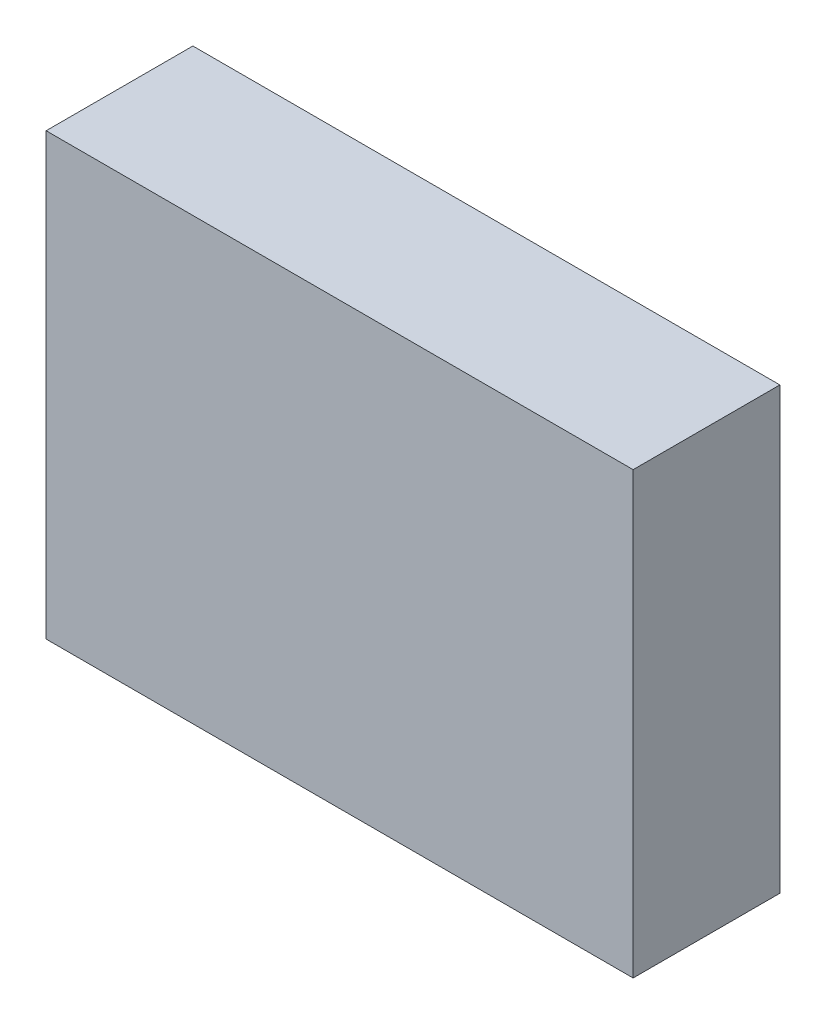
ISO-10303-21;
HEADER;
FILE_DESCRIPTION(('STEP AP214'),'2;1');
FILE_NAME('part.step','',(''),(''),'','','');
FILE_SCHEMA(('AUTOMOTIVE_DESIGN { 1 0 10303 214 1 1 1 1 }'));
ENDSEC;
DATA;
#1=APPLICATION_CONTEXT('core data for automotive mechanical design processes');
#2=APPLICATION_PROTOCOL_DEFINITION('international standard','automotive_design',2000,#1);
#3=PRODUCT_CONTEXT('',#1,'mechanical');
#4=PRODUCT('Part','Part','',(#3));
#5=PRODUCT_RELATED_PRODUCT_CATEGORY('part','',(#4));
#6=PRODUCT_DEFINITION_FORMATION('','',#4);
#7=PRODUCT_DEFINITION_CONTEXT('part definition',#1,'design');
#8=PRODUCT_DEFINITION('design','',#6,#7);
#9=PRODUCT_DEFINITION_SHAPE('','',#8);
#10=(LENGTH_UNIT() NAMED_UNIT(*) SI_UNIT(.MILLI.,.METRE.));
#11=(NAMED_UNIT(*) PLANE_ANGLE_UNIT() SI_UNIT($,.RADIAN.));
#12=(NAMED_UNIT(*) SI_UNIT($,.STERADIAN.) SOLID_ANGLE_UNIT());
#13=UNCERTAINTY_MEASURE_WITH_UNIT(LENGTH_MEASURE(1.E-05),#10,'distance_accuracy_value','');
#14=(GEOMETRIC_REPRESENTATION_CONTEXT(3) GLOBAL_UNCERTAINTY_ASSIGNED_CONTEXT((#13)) GLOBAL_UNIT_ASSIGNED_CONTEXT((#10,
#11,#12)) REPRESENTATION_CONTEXT('',''));
#15=CARTESIAN_POINT('',(0.,0.,0.));
#16=DIRECTION('',(0.,0.,1.));
#17=DIRECTION('',(1.,0.,0.));
#18=AXIS2_PLACEMENT_3D('',#15,#16,#17);
#19=CARTESIAN_POINT('',(0.,0.,3.));
#20=DIRECTION('',(1.,0.,0.));
#21=DIRECTION('',(0.,0.,-1.));
#22=AXIS2_PLACEMENT_3D('',#19,#20,#21);
#23=PLANE('',#22);
#24=DIRECTION('',(0.,-1.,0.));
#25=VECTOR('',#24,1.);
#26=CARTESIAN_POINT('',(0.,0.,0.));
#27=LINE('',#26,#25);
#28=CARTESIAN_POINT('',(0.,9.,0.));
#29=VERTEX_POINT('',#28);
#30=CARTESIAN_POINT('',(0.,0.,0.));
#31=VERTEX_POINT('',#30);
#32=EDGE_CURVE('E394',#29,#31,#27,.T.);
#33=ORIENTED_EDGE('',*,*,#32,.T.);
#34=DIRECTION('',(0.,0.,-1.));
#35=VECTOR('',#34,1.);
#36=CARTESIAN_POINT('',(0.,0.,3.));
#37=LINE('',#36,#35);
#38=CARTESIAN_POINT('',(0.,0.,3.));
#39=VERTEX_POINT('',#38);
#40=EDGE_CURVE('E11',#39,#31,#37,.T.);
#41=ORIENTED_EDGE('',*,*,#40,.F.);
#42=DIRECTION('',(0.,-1.,0.));
#43=VECTOR('',#42,1.);
#44=CARTESIAN_POINT('',(0.,0.,3.));
#45=LINE('',#44,#43);
#46=CARTESIAN_POINT('',(0.,9.,3.));
#47=VERTEX_POINT('',#46);
#48=EDGE_CURVE('E412',#47,#39,#45,.T.);
#49=ORIENTED_EDGE('',*,*,#48,.F.);
#50=DIRECTION('',(0.,0.,-1.));
#51=VECTOR('',#50,1.);
#52=CARTESIAN_POINT('',(0.,9.,3.));
#53=LINE('',#52,#51);
#54=EDGE_CURVE('E406',#47,#29,#53,.T.);
#55=ORIENTED_EDGE('',*,*,#54,.T.);
#56=EDGE_LOOP('',(#33,#41,#49,#55));
#57=FACE_BOUND('',#56,.T.);
#58=ADVANCED_FACE('F350',(#57),#23,.F.);
#59=CARTESIAN_POINT('',(0.,0.,3.));
#60=DIRECTION('',(0.,1.,0.));
#61=DIRECTION('',(0.,0.,1.));
#62=AXIS2_PLACEMENT_3D('',#59,#60,#61);
#63=PLANE('',#62);
#64=DIRECTION('',(1.,0.,0.));
#65=VECTOR('',#64,1.);
#66=CARTESIAN_POINT('',(0.,0.,0.));
#67=LINE('',#66,#65);
#68=CARTESIAN_POINT('',(12.,0.,0.));
#69=VERTEX_POINT('',#68);
#70=EDGE_CURVE('E390',#31,#69,#67,.T.);
#71=ORIENTED_EDGE('',*,*,#70,.T.);
#72=DIRECTION('',(0.,0.,-1.));
#73=VECTOR('',#72,1.);
#74=CARTESIAN_POINT('',(12.,0.,3.));
#75=LINE('',#74,#73);
#76=CARTESIAN_POINT('',(12.,0.,3.));
#77=VERTEX_POINT('',#76);
#78=EDGE_CURVE('E357',#77,#69,#75,.T.);
#79=ORIENTED_EDGE('',*,*,#78,.F.);
#80=DIRECTION('',(1.,0.,0.));
#81=VECTOR('',#80,1.);
#82=CARTESIAN_POINT('',(0.,0.,3.));
#83=LINE('',#82,#81);
#84=EDGE_CURVE('E402',#39,#77,#83,.T.);
#85=ORIENTED_EDGE('',*,*,#84,.F.);
#86=ORIENTED_EDGE('',*,*,#40,.T.);
#87=EDGE_LOOP('',(#71,#79,#85,#86));
#88=FACE_BOUND('',#87,.T.);
#89=ADVANCED_FACE('F401',(#88),#63,.F.);
#90=CARTESIAN_POINT('',(12.,0.,3.));
#91=DIRECTION('',(-1.,0.,0.));
#92=DIRECTION('',(0.,0.,1.));
#93=AXIS2_PLACEMENT_3D('',#90,#91,#92);
#94=PLANE('',#93);
#95=DIRECTION('',(0.,1.,0.));
#96=VECTOR('',#95,1.);
#97=CARTESIAN_POINT('',(12.,0.,0.));
#98=LINE('',#97,#96);
#99=CARTESIAN_POINT('',(12.,9.,0.));
#100=VERTEX_POINT('',#99);
#101=EDGE_CURVE('E395',#69,#100,#98,.T.);
#102=ORIENTED_EDGE('',*,*,#101,.T.);
#103=DIRECTION('',(0.,0.,-1.));
#104=VECTOR('',#103,1.);
#105=CARTESIAN_POINT('',(12.,9.,3.));
#106=LINE('',#105,#104);
#107=CARTESIAN_POINT('',(12.,9.,3.));
#108=VERTEX_POINT('',#107);
#109=EDGE_CURVE('E418',#108,#100,#106,.T.);
#110=ORIENTED_EDGE('',*,*,#109,.F.);
#111=DIRECTION('',(0.,1.,0.));
#112=VECTOR('',#111,1.);
#113=CARTESIAN_POINT('',(12.,0.,3.));
#114=LINE('',#113,#112);
#115=EDGE_CURVE('E369',#77,#108,#114,.T.);
#116=ORIENTED_EDGE('',*,*,#115,.F.);
#117=ORIENTED_EDGE('',*,*,#78,.T.);
#118=EDGE_LOOP('',(#102,#110,#116,#117));
#119=FACE_BOUND('',#118,.T.);
#120=ADVANCED_FACE('F421',(#119),#94,.F.);
#121=CARTESIAN_POINT('',(0.,9.,3.));
#122=DIRECTION('',(0.,-1.,0.));
#123=DIRECTION('',(0.,0.,-1.));
#124=AXIS2_PLACEMENT_3D('',#121,#122,#123);
#125=PLANE('',#124);
#126=DIRECTION('',(-1.,0.,0.));
#127=VECTOR('',#126,1.);
#128=CARTESIAN_POINT('',(0.,9.,0.));
#129=LINE('',#128,#127);
#130=EDGE_CURVE('E410',#100,#29,#129,.T.);
#131=ORIENTED_EDGE('',*,*,#130,.T.);
#132=ORIENTED_EDGE('',*,*,#54,.F.);
#133=DIRECTION('',(-1.,0.,0.));
#134=VECTOR('',#133,1.);
#135=CARTESIAN_POINT('',(0.,9.,3.));
#136=LINE('',#135,#134);
#137=EDGE_CURVE('E364',#108,#47,#136,.T.);
#138=ORIENTED_EDGE('',*,*,#137,.F.);
#139=ORIENTED_EDGE('',*,*,#109,.T.);
#140=EDGE_LOOP('',(#131,#132,#138,#139));
#141=FACE_BOUND('',#140,.T.);
#142=ADVANCED_FACE('F423',(#141),#125,.F.);
#143=CARTESIAN_POINT('',(0.,9.,3.));
#144=DIRECTION('',(0.,0.,-1.));
#145=DIRECTION('',(-1.,0.,0.));
#146=AXIS2_PLACEMENT_3D('',#143,#144,#145);
#147=PLANE('',#146);
#148=ORIENTED_EDGE('',*,*,#48,.T.);
#149=ORIENTED_EDGE('',*,*,#84,.T.);
#150=ORIENTED_EDGE('',*,*,#115,.T.);
#151=ORIENTED_EDGE('',*,*,#137,.T.);
#152=EDGE_LOOP('',(#148,#149,#150,#151));
#153=FACE_BOUND('',#152,.T.);
#154=ADVANCED_FACE('F424',(#153),#147,.F.);
#155=CARTESIAN_POINT('',(0.,9.,0.));
#156=DIRECTION('',(0.,0.,-1.));
#157=DIRECTION('',(-1.,0.,0.));
#158=AXIS2_PLACEMENT_3D('',#155,#156,#157);
#159=PLANE('',#158);
#160=ORIENTED_EDGE('',*,*,#32,.F.);
#161=ORIENTED_EDGE('',*,*,#130,.F.);
#162=ORIENTED_EDGE('',*,*,#101,.F.);
#163=ORIENTED_EDGE('',*,*,#70,.F.);
#164=EDGE_LOOP('',(#160,#161,#162,#163));
#165=FACE_BOUND('',#164,.T.);
#166=ADVANCED_FACE('F391',(#165),#159,.T.);
#167=CLOSED_SHELL('',(#58,#89,#120,#142,#154,#166));
#168=MANIFOLD_SOLID_BREP('B2',#167);
#169=ADVANCED_BREP_SHAPE_REPRESENTATION('',(#18,#168),#14);
#170=SHAPE_DEFINITION_REPRESENTATION(#9,#169);
ENDSEC;
END-ISO-10303-21;
